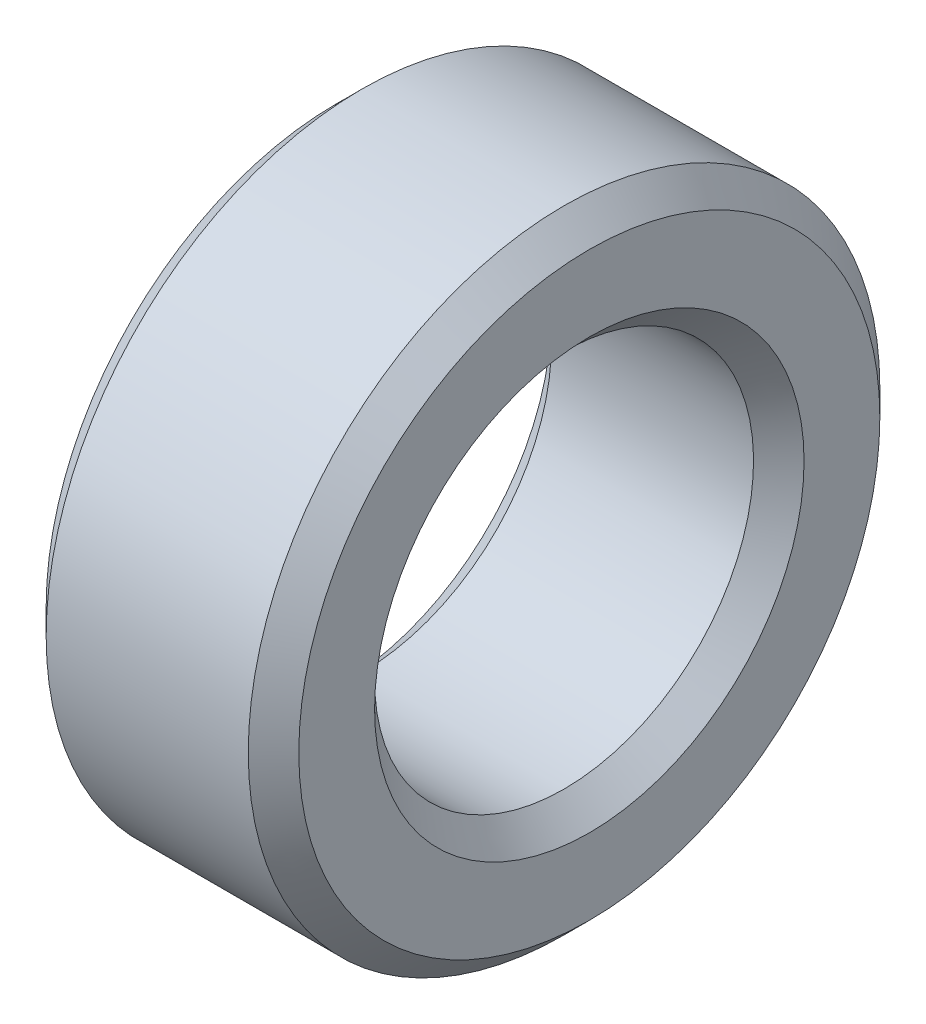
ISO-10303-21;
HEADER;
FILE_DESCRIPTION(('STEP AP214'),'2;1');
FILE_NAME('part.step','',(''),(''),'','','');
FILE_SCHEMA(('AUTOMOTIVE_DESIGN { 1 0 10303 214 1 1 1 1 }'));
ENDSEC;
DATA;
#1=APPLICATION_CONTEXT('core data for automotive mechanical design processes');
#2=APPLICATION_PROTOCOL_DEFINITION('international standard','automotive_design',2000,#1);
#3=PRODUCT_CONTEXT('',#1,'mechanical');
#4=PRODUCT('Part','Part','',(#3));
#5=PRODUCT_RELATED_PRODUCT_CATEGORY('part','',(#4));
#6=PRODUCT_DEFINITION_FORMATION('','',#4);
#7=PRODUCT_DEFINITION_CONTEXT('part definition',#1,'design');
#8=PRODUCT_DEFINITION('design','',#6,#7);
#9=PRODUCT_DEFINITION_SHAPE('','',#8);
#10=(LENGTH_UNIT() NAMED_UNIT(*) SI_UNIT(.MILLI.,.METRE.));
#11=(NAMED_UNIT(*) PLANE_ANGLE_UNIT() SI_UNIT($,.RADIAN.));
#12=(NAMED_UNIT(*) SI_UNIT($,.STERADIAN.) SOLID_ANGLE_UNIT());
#13=UNCERTAINTY_MEASURE_WITH_UNIT(LENGTH_MEASURE(1.E-05),#10,'distance_accuracy_value','');
#14=(GEOMETRIC_REPRESENTATION_CONTEXT(3) GLOBAL_UNCERTAINTY_ASSIGNED_CONTEXT((#13)) GLOBAL_UNIT_ASSIGNED_CONTEXT((#10,
#11,#12)) REPRESENTATION_CONTEXT('',''));
#15=CARTESIAN_POINT('',(0.,0.,0.));
#16=DIRECTION('',(0.,0.,1.));
#17=DIRECTION('',(1.,0.,0.));
#18=AXIS2_PLACEMENT_3D('',#15,#16,#17);
#19=CARTESIAN_POINT('',(0.,-4.,0.));
#20=DIRECTION('',(-1.,0.,0.));
#21=DIRECTION('',(0.,1.,0.));
#22=AXIS2_PLACEMENT_3D('',#19,#20,#21);
#23=PLANE('',#22);
#24=CARTESIAN_POINT('',(0.,0.,0.));
#25=DIRECTION('',(1.,0.,0.));
#26=DIRECTION('',(0.,-1.,0.));
#27=AXIS2_PLACEMENT_3D('',#24,#25,#26);
#28=CIRCLE('',#27,3.4);
#29=CARTESIAN_POINT('',(0.,-3.4,0.));
#30=VERTEX_POINT('',#29);
#31=EDGE_CURVE('E9',#30,#30,#28,.T.);
#32=ORIENTED_EDGE('',*,*,#31,.T.);
#33=EDGE_LOOP('',(#32));
#34=FACE_BOUND('',#33,.T.);
#35=CARTESIAN_POINT('',(0.,0.,0.));
#36=DIRECTION('',(1.,0.,0.));
#37=DIRECTION('',(0.,-1.,0.));
#38=AXIS2_PLACEMENT_3D('',#35,#36,#37);
#39=CIRCLE('',#38,4.6);
#40=CARTESIAN_POINT('',(0.,-4.6,0.));
#41=VERTEX_POINT('',#40);
#42=EDGE_CURVE('E53',#41,#41,#39,.T.);
#43=ORIENTED_EDGE('',*,*,#42,.F.);
#44=EDGE_LOOP('',(#43));
#45=FACE_BOUND('',#44,.T.);
#46=ADVANCED_FACE('F15',(#34,#45),#23,.T.);
#47=CARTESIAN_POINT('',(0.2,0.,0.));
#48=DIRECTION('',(-1.,0.,0.));
#49=DIRECTION('',(0.,-1.,0.));
#50=AXIS2_PLACEMENT_3D('',#47,#48,#49);
#51=CONICAL_SURFACE('',#50,3.2,0.785398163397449);
#52=CARTESIAN_POINT('',(0.4,0.,0.));
#53=DIRECTION('',(1.,0.,0.));
#54=DIRECTION('',(0.,-1.,0.));
#55=AXIS2_PLACEMENT_3D('',#52,#53,#54);
#56=CIRCLE('',#55,3.);
#57=CARTESIAN_POINT('',(0.4,-3.,0.));
#58=VERTEX_POINT('',#57);
#59=EDGE_CURVE('E22',#58,#58,#56,.T.);
#60=ORIENTED_EDGE('',*,*,#59,.T.);
#61=EDGE_LOOP('',(#60));
#62=FACE_BOUND('',#61,.T.);
#63=ORIENTED_EDGE('',*,*,#31,.F.);
#64=EDGE_LOOP('',(#63));
#65=FACE_BOUND('',#64,.T.);
#66=ADVANCED_FACE('F82',(#62,#65),#51,.F.);
#67=CARTESIAN_POINT('',(2.,0.,0.));
#68=DIRECTION('',(-1.,0.,0.));
#69=DIRECTION('',(0.,-1.,0.));
#70=AXIS2_PLACEMENT_3D('',#67,#68,#69);
#71=CYLINDRICAL_SURFACE('',#70,3.);
#72=CARTESIAN_POINT('',(3.6,0.,0.));
#73=DIRECTION('',(1.,0.,0.));
#74=DIRECTION('',(0.,-1.,0.));
#75=AXIS2_PLACEMENT_3D('',#72,#73,#74);
#76=CIRCLE('',#75,3.);
#77=CARTESIAN_POINT('',(3.6,-3.,0.));
#78=VERTEX_POINT('',#77);
#79=EDGE_CURVE('E58',#78,#78,#76,.T.);
#80=ORIENTED_EDGE('',*,*,#79,.T.);
#81=EDGE_LOOP('',(#80));
#82=FACE_BOUND('',#81,.T.);
#83=ORIENTED_EDGE('',*,*,#59,.F.);
#84=EDGE_LOOP('',(#83));
#85=FACE_BOUND('',#84,.T.);
#86=ADVANCED_FACE('F66',(#82,#85),#71,.F.);
#87=CARTESIAN_POINT('',(3.8,0.,0.));
#88=DIRECTION('',(1.,0.,0.));
#89=DIRECTION('',(0.,-1.,0.));
#90=AXIS2_PLACEMENT_3D('',#87,#88,#89);
#91=CONICAL_SURFACE('',#90,3.2,0.78539816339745);
#92=CARTESIAN_POINT('',(4.,0.,0.));
#93=DIRECTION('',(1.,0.,0.));
#94=DIRECTION('',(0.,-1.,0.));
#95=AXIS2_PLACEMENT_3D('',#92,#93,#94);
#96=CIRCLE('',#95,3.4);
#97=CARTESIAN_POINT('',(4.,-3.4,0.));
#98=VERTEX_POINT('',#97);
#99=EDGE_CURVE('E63',#98,#98,#96,.T.);
#100=ORIENTED_EDGE('',*,*,#99,.T.);
#101=EDGE_LOOP('',(#100));
#102=FACE_BOUND('',#101,.T.);
#103=ORIENTED_EDGE('',*,*,#79,.F.);
#104=EDGE_LOOP('',(#103));
#105=FACE_BOUND('',#104,.T.);
#106=ADVANCED_FACE('F69',(#102,#105),#91,.F.);
#107=CARTESIAN_POINT('',(4.,-4.,0.));
#108=DIRECTION('',(1.,0.,0.));
#109=DIRECTION('',(0.,-1.,0.));
#110=AXIS2_PLACEMENT_3D('',#107,#108,#109);
#111=PLANE('',#110);
#112=CARTESIAN_POINT('',(4.,0.,0.));
#113=DIRECTION('',(1.,0.,0.));
#114=DIRECTION('',(0.,-1.,0.));
#115=AXIS2_PLACEMENT_3D('',#112,#113,#114);
#116=CIRCLE('',#115,4.6);
#117=CARTESIAN_POINT('',(4.,-4.6,0.));
#118=VERTEX_POINT('',#117);
#119=EDGE_CURVE('E61',#118,#118,#116,.T.);
#120=ORIENTED_EDGE('',*,*,#119,.T.);
#121=EDGE_LOOP('',(#120));
#122=FACE_BOUND('',#121,.T.);
#123=ORIENTED_EDGE('',*,*,#99,.F.);
#124=EDGE_LOOP('',(#123));
#125=FACE_BOUND('',#124,.T.);
#126=ADVANCED_FACE('F71',(#122,#125),#111,.T.);
#127=CARTESIAN_POINT('',(3.8,0.,0.));
#128=DIRECTION('',(-1.,0.,0.));
#129=DIRECTION('',(0.,-1.,0.));
#130=AXIS2_PLACEMENT_3D('',#127,#128,#129);
#131=CONICAL_SURFACE('',#130,4.8,0.785398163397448);
#132=CARTESIAN_POINT('',(3.6,0.,0.));
#133=DIRECTION('',(1.,0.,0.));
#134=DIRECTION('',(0.,-1.,0.));
#135=AXIS2_PLACEMENT_3D('',#132,#133,#134);
#136=CIRCLE('',#135,5.);
#137=CARTESIAN_POINT('',(3.6,-5.,0.));
#138=VERTEX_POINT('',#137);
#139=EDGE_CURVE('E55',#138,#138,#136,.T.);
#140=ORIENTED_EDGE('',*,*,#139,.T.);
#141=EDGE_LOOP('',(#140));
#142=FACE_BOUND('',#141,.T.);
#143=ORIENTED_EDGE('',*,*,#119,.F.);
#144=EDGE_LOOP('',(#143));
#145=FACE_BOUND('',#144,.T.);
#146=ADVANCED_FACE('F79',(#142,#145),#131,.T.);
#147=CARTESIAN_POINT('',(2.,0.,0.));
#148=DIRECTION('',(-1.,0.,0.));
#149=DIRECTION('',(0.,-1.,0.));
#150=AXIS2_PLACEMENT_3D('',#147,#148,#149);
#151=CYLINDRICAL_SURFACE('',#150,5.);
#152=CARTESIAN_POINT('',(0.4,0.,0.));
#153=DIRECTION('',(1.,0.,0.));
#154=DIRECTION('',(0.,-1.,0.));
#155=AXIS2_PLACEMENT_3D('',#152,#153,#154);
#156=CIRCLE('',#155,5.);
#157=CARTESIAN_POINT('',(0.4,-5.,0.));
#158=VERTEX_POINT('',#157);
#159=EDGE_CURVE('E49',#158,#158,#156,.T.);
#160=ORIENTED_EDGE('',*,*,#159,.T.);
#161=EDGE_LOOP('',(#160));
#162=FACE_BOUND('',#161,.T.);
#163=ORIENTED_EDGE('',*,*,#139,.F.);
#164=EDGE_LOOP('',(#163));
#165=FACE_BOUND('',#164,.T.);
#166=ADVANCED_FACE('F50',(#162,#165),#151,.T.);
#167=CARTESIAN_POINT('',(0.2,0.,0.));
#168=DIRECTION('',(1.,0.,0.));
#169=DIRECTION('',(0.,-1.,0.));
#170=AXIS2_PLACEMENT_3D('',#167,#168,#169);
#171=CONICAL_SURFACE('',#170,4.8,0.785398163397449);
#172=ORIENTED_EDGE('',*,*,#42,.T.);
#173=EDGE_LOOP('',(#172));
#174=FACE_BOUND('',#173,.T.);
#175=ORIENTED_EDGE('',*,*,#159,.F.);
#176=EDGE_LOOP('',(#175));
#177=FACE_BOUND('',#176,.T.);
#178=ADVANCED_FACE('F92',(#174,#177),#171,.T.);
#179=CLOSED_SHELL('',(#46,#66,#86,#106,#126,#146,#166,#178));
#180=MANIFOLD_SOLID_BREP('B1',#179);
#181=ADVANCED_BREP_SHAPE_REPRESENTATION('',(#18,#180),#14);
#182=SHAPE_DEFINITION_REPRESENTATION(#9,#181);
ENDSEC;
END-ISO-10303-21;
